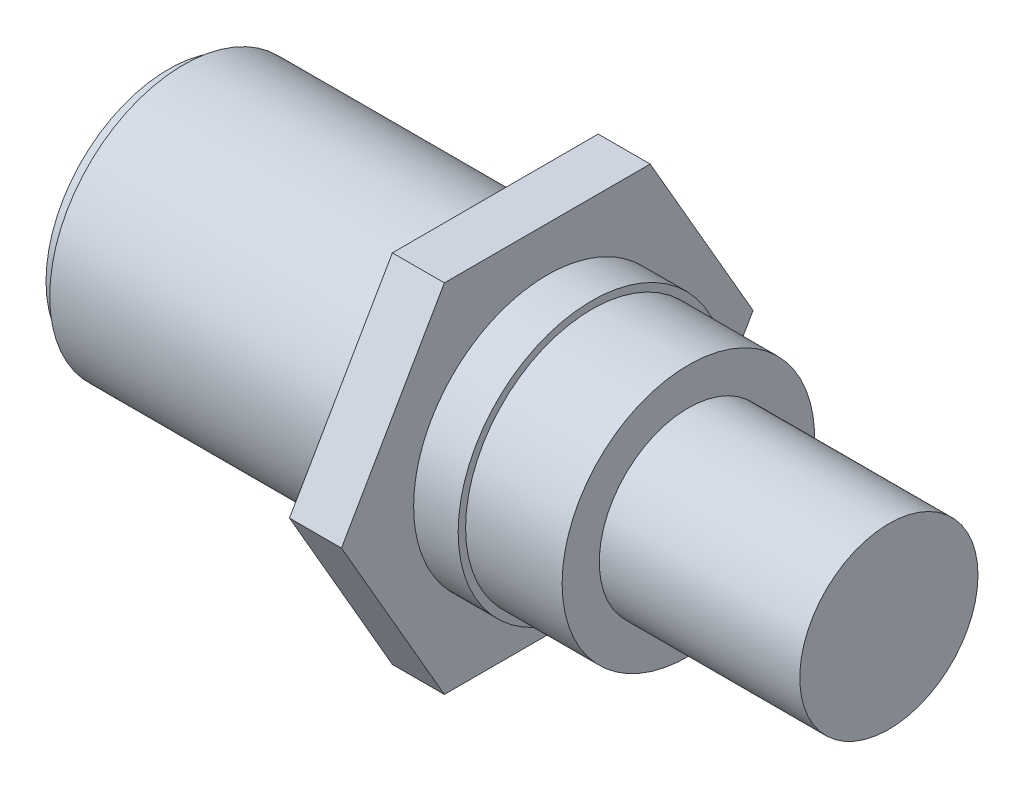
ISO-10303-21;
HEADER;
FILE_DESCRIPTION(('STEP AP214'),'2;1');
FILE_NAME('part.step','',(''),(''),'','','');
FILE_SCHEMA(('AUTOMOTIVE_DESIGN { 1 0 10303 214 1 1 1 1 }'));
ENDSEC;
DATA;
#1=APPLICATION_CONTEXT('core data for automotive mechanical design processes');
#2=APPLICATION_PROTOCOL_DEFINITION('international standard','automotive_design',2000,#1);
#3=PRODUCT_CONTEXT('',#1,'mechanical');
#4=PRODUCT('Part','Part','',(#3));
#5=PRODUCT_RELATED_PRODUCT_CATEGORY('part','',(#4));
#6=PRODUCT_DEFINITION_FORMATION('','',#4);
#7=PRODUCT_DEFINITION_CONTEXT('part definition',#1,'design');
#8=PRODUCT_DEFINITION('design','',#6,#7);
#9=PRODUCT_DEFINITION_SHAPE('','',#8);
#10=(LENGTH_UNIT() NAMED_UNIT(*) SI_UNIT(.MILLI.,.METRE.));
#11=(NAMED_UNIT(*) PLANE_ANGLE_UNIT() SI_UNIT($,.RADIAN.));
#12=(NAMED_UNIT(*) SI_UNIT($,.STERADIAN.) SOLID_ANGLE_UNIT());
#13=UNCERTAINTY_MEASURE_WITH_UNIT(LENGTH_MEASURE(1.E-05),#10,'distance_accuracy_value','');
#14=(GEOMETRIC_REPRESENTATION_CONTEXT(3) GLOBAL_UNCERTAINTY_ASSIGNED_CONTEXT((#13)) GLOBAL_UNIT_ASSIGNED_CONTEXT((#10,
#11,#12)) REPRESENTATION_CONTEXT('',''));
#15=CARTESIAN_POINT('',(0.,0.,0.));
#16=DIRECTION('',(0.,0.,1.));
#17=DIRECTION('',(1.,0.,0.));
#18=AXIS2_PLACEMENT_3D('',#15,#16,#17);
#19=CARTESIAN_POINT('',(24.5,24.,0.));
#20=DIRECTION('',(1.,0.,0.));
#21=DIRECTION('',(0.,0.,-1.));
#22=AXIS2_PLACEMENT_3D('',#19,#20,#21);
#23=PLANE('',#22);
#24=DIRECTION('',(0.,0.866025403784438,0.5));
#25=VECTOR('',#24,1.);
#26=CARTESIAN_POINT('',(24.5,0.,-13.856406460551));
#27=LINE('',#26,#25);
#28=CARTESIAN_POINT('',(24.5,0.,-13.856406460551));
#29=VERTEX_POINT('',#28);
#30=CARTESIAN_POINT('',(24.5,12.,-6.9282032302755));
#31=VERTEX_POINT('',#30);
#32=EDGE_CURVE('E130',#29,#31,#27,.T.);
#33=ORIENTED_EDGE('',*,*,#32,.T.);
#34=DIRECTION('',(0.,0.,1.));
#35=VECTOR('',#34,1.);
#36=CARTESIAN_POINT('',(24.5,12.,-6.9282032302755));
#37=LINE('',#36,#35);
#38=CARTESIAN_POINT('',(24.5,12.,6.92820323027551));
#39=VERTEX_POINT('',#38);
#40=EDGE_CURVE('E111',#31,#39,#37,.T.);
#41=ORIENTED_EDGE('',*,*,#40,.T.);
#42=DIRECTION('',(0.,-0.866025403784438,0.5));
#43=VECTOR('',#42,1.);
#44=CARTESIAN_POINT('',(24.5,12.,6.92820323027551));
#45=LINE('',#44,#43);
#46=CARTESIAN_POINT('',(24.5,0.,13.856406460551));
#47=VERTEX_POINT('',#46);
#48=EDGE_CURVE('E133',#39,#47,#45,.T.);
#49=ORIENTED_EDGE('',*,*,#48,.T.);
#50=DIRECTION('',(0.,-0.866025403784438,-0.5));
#51=VECTOR('',#50,1.);
#52=CARTESIAN_POINT('',(24.5,0.,13.856406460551));
#53=LINE('',#52,#51);
#54=CARTESIAN_POINT('',(24.5,-12.,6.9282032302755));
#55=VERTEX_POINT('',#54);
#56=EDGE_CURVE('E135',#47,#55,#53,.T.);
#57=ORIENTED_EDGE('',*,*,#56,.T.);
#58=DIRECTION('',(0.,0.,-1.));
#59=VECTOR('',#58,1.);
#60=CARTESIAN_POINT('',(24.5,-12.,6.9282032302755));
#61=LINE('',#60,#59);
#62=CARTESIAN_POINT('',(24.5,-12.,-6.92820323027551));
#63=VERTEX_POINT('',#62);
#64=EDGE_CURVE('E64',#55,#63,#61,.T.);
#65=ORIENTED_EDGE('',*,*,#64,.T.);
#66=DIRECTION('',(0.,0.866025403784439,-0.5));
#67=VECTOR('',#66,1.);
#68=CARTESIAN_POINT('',(24.5,-12.,-6.92820323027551));
#69=LINE('',#68,#67);
#70=EDGE_CURVE('E59',#63,#29,#69,.T.);
#71=ORIENTED_EDGE('',*,*,#70,.T.);
#72=EDGE_LOOP('',(#33,#41,#49,#57,#65,#71));
#73=FACE_BOUND('',#72,.T.);
#74=CARTESIAN_POINT('',(24.5,0.,0.));
#75=DIRECTION('',(1.,0.,0.));
#76=DIRECTION('',(0.,0.,-1.));
#77=AXIS2_PLACEMENT_3D('',#74,#75,#76);
#78=CIRCLE('',#77,9.);
#79=CARTESIAN_POINT('',(24.5,0.,-9.));
#80=VERTEX_POINT('',#79);
#81=EDGE_CURVE('E116',#80,#80,#78,.T.);
#82=ORIENTED_EDGE('',*,*,#81,.F.);
#83=EDGE_LOOP('',(#82));
#84=FACE_BOUND('',#83,.T.);
#85=ADVANCED_FACE('F44',(#73,#84),#23,.T.);
#86=CARTESIAN_POINT('',(21.,24.,0.));
#87=DIRECTION('',(1.,0.,0.));
#88=DIRECTION('',(0.,0.,-1.));
#89=AXIS2_PLACEMENT_3D('',#86,#87,#88);
#90=PLANE('',#89);
#91=DIRECTION('',(0.,0.866025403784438,0.5));
#92=VECTOR('',#91,1.);
#93=CARTESIAN_POINT('',(21.,0.,-13.856406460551));
#94=LINE('',#93,#92);
#95=CARTESIAN_POINT('',(21.,0.,-13.856406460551));
#96=VERTEX_POINT('',#95);
#97=CARTESIAN_POINT('',(21.,12.,-6.9282032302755));
#98=VERTEX_POINT('',#97);
#99=EDGE_CURVE('E102',#96,#98,#94,.T.);
#100=ORIENTED_EDGE('',*,*,#99,.F.);
#101=DIRECTION('',(0.,0.866025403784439,-0.5));
#102=VECTOR('',#101,1.);
#103=CARTESIAN_POINT('',(21.,-12.,-6.92820323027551));
#104=LINE('',#103,#102);
#105=CARTESIAN_POINT('',(21.,-12.,-6.92820323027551));
#106=VERTEX_POINT('',#105);
#107=EDGE_CURVE('E128',#106,#96,#104,.T.);
#108=ORIENTED_EDGE('',*,*,#107,.F.);
#109=DIRECTION('',(0.,0.,-1.));
#110=VECTOR('',#109,1.);
#111=CARTESIAN_POINT('',(21.,-12.,6.9282032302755));
#112=LINE('',#111,#110);
#113=CARTESIAN_POINT('',(21.,-12.,6.9282032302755));
#114=VERTEX_POINT('',#113);
#115=EDGE_CURVE('E126',#114,#106,#112,.T.);
#116=ORIENTED_EDGE('',*,*,#115,.F.);
#117=DIRECTION('',(0.,-0.866025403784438,-0.5));
#118=VECTOR('',#117,1.);
#119=CARTESIAN_POINT('',(21.,0.,13.856406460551));
#120=LINE('',#119,#118);
#121=CARTESIAN_POINT('',(21.,0.,13.856406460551));
#122=VERTEX_POINT('',#121);
#123=EDGE_CURVE('E124',#122,#114,#120,.T.);
#124=ORIENTED_EDGE('',*,*,#123,.F.);
#125=DIRECTION('',(0.,-0.866025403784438,0.5));
#126=VECTOR('',#125,1.);
#127=CARTESIAN_POINT('',(21.,12.,6.92820323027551));
#128=LINE('',#127,#126);
#129=CARTESIAN_POINT('',(21.,12.,6.92820323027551));
#130=VERTEX_POINT('',#129);
#131=EDGE_CURVE('E104',#130,#122,#128,.T.);
#132=ORIENTED_EDGE('',*,*,#131,.F.);
#133=DIRECTION('',(0.,0.,1.));
#134=VECTOR('',#133,1.);
#135=CARTESIAN_POINT('',(21.,12.,-6.9282032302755));
#136=LINE('',#135,#134);
#137=EDGE_CURVE('E97',#98,#130,#136,.T.);
#138=ORIENTED_EDGE('',*,*,#137,.F.);
#139=EDGE_LOOP('',(#100,#108,#116,#124,#132,#138));
#140=FACE_BOUND('',#139,.T.);
#141=CARTESIAN_POINT('',(21.,0.,0.));
#142=DIRECTION('',(1.,0.,0.));
#143=DIRECTION('',(0.,0.,-1.));
#144=AXIS2_PLACEMENT_3D('',#141,#142,#143);
#145=CIRCLE('',#144,9.);
#146=CARTESIAN_POINT('',(21.,0.,-9.));
#147=VERTEX_POINT('',#146);
#148=EDGE_CURVE('E119',#147,#147,#145,.T.);
#149=ORIENTED_EDGE('',*,*,#148,.T.);
#150=EDGE_LOOP('',(#149));
#151=FACE_BOUND('',#150,.T.);
#152=ADVANCED_FACE('F98',(#140,#151),#90,.F.);
#153=CARTESIAN_POINT('',(24.5,0.,-13.856406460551));
#154=DIRECTION('',(0.,-0.5,0.866025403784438));
#155=DIRECTION('',(0.,-0.866025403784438,-0.5));
#156=AXIS2_PLACEMENT_3D('',#153,#154,#155);
#157=PLANE('',#156);
#158=ORIENTED_EDGE('',*,*,#99,.T.);
#159=DIRECTION('',(-1.,0.,0.));
#160=VECTOR('',#159,1.);
#161=CARTESIAN_POINT('',(24.5,12.,-6.9282032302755));
#162=LINE('',#161,#160);
#163=EDGE_CURVE('E12',#31,#98,#162,.T.);
#164=ORIENTED_EDGE('',*,*,#163,.F.);
#165=ORIENTED_EDGE('',*,*,#32,.F.);
#166=DIRECTION('',(-1.,0.,0.));
#167=VECTOR('',#166,1.);
#168=CARTESIAN_POINT('',(24.5,0.,-13.856406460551));
#169=LINE('',#168,#167);
#170=EDGE_CURVE('E115',#29,#96,#169,.T.);
#171=ORIENTED_EDGE('',*,*,#170,.T.);
#172=EDGE_LOOP('',(#158,#164,#165,#171));
#173=FACE_BOUND('',#172,.T.);
#174=ADVANCED_FACE('F46',(#173),#157,.F.);
#175=CARTESIAN_POINT('',(24.5,12.,-6.9282032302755));
#176=DIRECTION('',(0.,-1.,0.));
#177=DIRECTION('',(0.,0.,-1.));
#178=AXIS2_PLACEMENT_3D('',#175,#176,#177);
#179=PLANE('',#178);
#180=ORIENTED_EDGE('',*,*,#137,.T.);
#181=DIRECTION('',(-1.,0.,0.));
#182=VECTOR('',#181,1.);
#183=CARTESIAN_POINT('',(24.5,12.,6.92820323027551));
#184=LINE('',#183,#182);
#185=EDGE_CURVE('E52',#39,#130,#184,.T.);
#186=ORIENTED_EDGE('',*,*,#185,.F.);
#187=ORIENTED_EDGE('',*,*,#40,.F.);
#188=ORIENTED_EDGE('',*,*,#163,.T.);
#189=EDGE_LOOP('',(#180,#186,#187,#188));
#190=FACE_BOUND('',#189,.T.);
#191=ADVANCED_FACE('F110',(#190),#179,.F.);
#192=CARTESIAN_POINT('',(24.5,12.,6.92820323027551));
#193=DIRECTION('',(0.,-0.5,-0.866025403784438));
#194=DIRECTION('',(0.,0.866025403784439,-0.5));
#195=AXIS2_PLACEMENT_3D('',#192,#193,#194);
#196=PLANE('',#195);
#197=ORIENTED_EDGE('',*,*,#131,.T.);
#198=DIRECTION('',(-1.,0.,0.));
#199=VECTOR('',#198,1.);
#200=CARTESIAN_POINT('',(24.5,0.,13.856406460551));
#201=LINE('',#200,#199);
#202=EDGE_CURVE('E146',#47,#122,#201,.T.);
#203=ORIENTED_EDGE('',*,*,#202,.F.);
#204=ORIENTED_EDGE('',*,*,#48,.F.);
#205=ORIENTED_EDGE('',*,*,#185,.T.);
#206=EDGE_LOOP('',(#197,#203,#204,#205));
#207=FACE_BOUND('',#206,.T.);
#208=ADVANCED_FACE('F150',(#207),#196,.F.);
#209=CARTESIAN_POINT('',(24.5,0.,13.856406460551));
#210=DIRECTION('',(0.,0.5,-0.866025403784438));
#211=DIRECTION('',(0.,0.866025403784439,0.5));
#212=AXIS2_PLACEMENT_3D('',#209,#210,#211);
#213=PLANE('',#212);
#214=ORIENTED_EDGE('',*,*,#123,.T.);
#215=DIRECTION('',(-1.,0.,0.));
#216=VECTOR('',#215,1.);
#217=CARTESIAN_POINT('',(24.5,-12.,6.9282032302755));
#218=LINE('',#217,#216);
#219=EDGE_CURVE('E143',#55,#114,#218,.T.);
#220=ORIENTED_EDGE('',*,*,#219,.F.);
#221=ORIENTED_EDGE('',*,*,#56,.F.);
#222=ORIENTED_EDGE('',*,*,#202,.T.);
#223=EDGE_LOOP('',(#214,#220,#221,#222));
#224=FACE_BOUND('',#223,.T.);
#225=ADVANCED_FACE('F156',(#224),#213,.F.);
#226=CARTESIAN_POINT('',(24.5,-12.,6.9282032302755));
#227=DIRECTION('',(0.,1.,0.));
#228=DIRECTION('',(0.,0.,1.));
#229=AXIS2_PLACEMENT_3D('',#226,#227,#228);
#230=PLANE('',#229);
#231=ORIENTED_EDGE('',*,*,#115,.T.);
#232=DIRECTION('',(-1.,0.,0.));
#233=VECTOR('',#232,1.);
#234=CARTESIAN_POINT('',(24.5,-12.,-6.92820323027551));
#235=LINE('',#234,#233);
#236=EDGE_CURVE('E140',#63,#106,#235,.T.);
#237=ORIENTED_EDGE('',*,*,#236,.F.);
#238=ORIENTED_EDGE('',*,*,#64,.F.);
#239=ORIENTED_EDGE('',*,*,#219,.T.);
#240=EDGE_LOOP('',(#231,#237,#238,#239));
#241=FACE_BOUND('',#240,.T.);
#242=ADVANCED_FACE('F159',(#241),#230,.F.);
#243=CARTESIAN_POINT('',(24.5,-12.,-6.92820323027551));
#244=DIRECTION('',(0.,0.5,0.866025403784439));
#245=DIRECTION('',(0.,-0.866025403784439,0.5));
#246=AXIS2_PLACEMENT_3D('',#243,#244,#245);
#247=PLANE('',#246);
#248=ORIENTED_EDGE('',*,*,#107,.T.);
#249=ORIENTED_EDGE('',*,*,#170,.F.);
#250=ORIENTED_EDGE('',*,*,#70,.F.);
#251=ORIENTED_EDGE('',*,*,#236,.T.);
#252=EDGE_LOOP('',(#248,#249,#250,#251));
#253=FACE_BOUND('',#252,.T.);
#254=ADVANCED_FACE('F161',(#253),#247,.F.);
#255=CARTESIAN_POINT('',(24.5,0.,0.));
#256=DIRECTION('',(-1.,0.,0.));
#257=DIRECTION('',(0.,0.,1.));
#258=AXIS2_PLACEMENT_3D('',#255,#256,#257);
#259=CYLINDRICAL_SURFACE('',#258,9.);
#260=ORIENTED_EDGE('',*,*,#81,.T.);
#261=EDGE_LOOP('',(#260));
#262=FACE_BOUND('',#261,.T.);
#263=ORIENTED_EDGE('',*,*,#148,.F.);
#264=EDGE_LOOP('',(#263));
#265=FACE_BOUND('',#264,.T.);
#266=ADVANCED_FACE('F163',(#262,#265),#259,.F.);
#267=CLOSED_SHELL('',(#85,#152,#174,#191,#208,#225,#242,#254,#266));
#268=MANIFOLD_SOLID_BREP('B2',#267);
#269=CARTESIAN_POINT('',(34.,0.,0.));
#270=DIRECTION('',(1.,0.,0.));
#271=DIRECTION('',(0.,0.,-1.));
#272=AXIS2_PLACEMENT_3D('',#269,#270,#271);
#273=PLANE('',#272);
#274=CARTESIAN_POINT('',(34.,0.,0.));
#275=DIRECTION('',(1.,0.,0.));
#276=DIRECTION('',(0.,0.,-1.));
#277=AXIS2_PLACEMENT_3D('',#274,#275,#276);
#278=CIRCLE('',#277,8.5);
#279=CARTESIAN_POINT('',(34.,0.,8.5));
#280=VERTEX_POINT('',#279);
#281=EDGE_CURVE('E263',#280,#280,#278,.T.);
#282=ORIENTED_EDGE('',*,*,#281,.T.);
#283=EDGE_LOOP('',(#282));
#284=FACE_BOUND('',#283,.T.);
#285=CARTESIAN_POINT('',(34.,0.,0.));
#286=DIRECTION('',(1.,0.,0.));
#287=DIRECTION('',(0.,0.,-1.));
#288=AXIS2_PLACEMENT_3D('',#285,#286,#287);
#289=CIRCLE('',#288,6.);
#290=CARTESIAN_POINT('',(34.,0.,-6.));
#291=VERTEX_POINT('',#290);
#292=EDGE_CURVE('E269',#291,#291,#289,.T.);
#293=ORIENTED_EDGE('',*,*,#292,.F.);
#294=EDGE_LOOP('',(#293));
#295=FACE_BOUND('',#294,.T.);
#296=ADVANCED_FACE('F240',(#284,#295),#273,.T.);
#297=CARTESIAN_POINT('',(27.5,0.,0.));
#298=DIRECTION('',(-1.,0.,0.));
#299=DIRECTION('',(0.,0.,1.));
#300=AXIS2_PLACEMENT_3D('',#297,#298,#299);
#301=PLANE('',#300);
#302=CARTESIAN_POINT('',(27.5,0.,0.));
#303=DIRECTION('',(-1.,0.,0.));
#304=DIRECTION('',(0.,0.,1.));
#305=AXIS2_PLACEMENT_3D('',#302,#303,#304);
#306=CIRCLE('',#305,9.);
#307=CARTESIAN_POINT('',(27.5,0.,9.));
#308=VERTEX_POINT('',#307);
#309=EDGE_CURVE('E255',#308,#308,#306,.T.);
#310=ORIENTED_EDGE('',*,*,#309,.F.);
#311=EDGE_LOOP('',(#310));
#312=FACE_BOUND('',#311,.T.);
#313=CARTESIAN_POINT('',(27.5,0.,0.));
#314=DIRECTION('',(-1.,0.,0.));
#315=DIRECTION('',(0.,0.,1.));
#316=AXIS2_PLACEMENT_3D('',#313,#314,#315);
#317=CIRCLE('',#316,8.5);
#318=CARTESIAN_POINT('',(27.5,0.,8.5));
#319=VERTEX_POINT('',#318);
#320=EDGE_CURVE('E43',#319,#319,#317,.F.);
#321=ORIENTED_EDGE('',*,*,#320,.F.);
#322=EDGE_LOOP('',(#321));
#323=FACE_BOUND('',#322,.T.);
#324=ADVANCED_FACE('F276',(#312,#323),#301,.F.);
#325=CARTESIAN_POINT('',(0.,0.,0.));
#326=DIRECTION('',(1.,0.,0.));
#327=DIRECTION('',(0.,0.,-1.));
#328=AXIS2_PLACEMENT_3D('',#325,#326,#327);
#329=PLANE('',#328);
#330=CARTESIAN_POINT('',(0.,0.,0.));
#331=DIRECTION('',(-1.,0.,0.));
#332=DIRECTION('',(0.,0.,1.));
#333=AXIS2_PLACEMENT_3D('',#330,#331,#332);
#334=CIRCLE('',#333,9.);
#335=CARTESIAN_POINT('',(0.,0.,9.));
#336=VERTEX_POINT('',#335);
#337=EDGE_CURVE('E251',#336,#336,#334,.T.);
#338=ORIENTED_EDGE('',*,*,#337,.T.);
#339=EDGE_LOOP('',(#338));
#340=FACE_BOUND('',#339,.T.);
#341=CARTESIAN_POINT('',(0.,0.,0.));
#342=DIRECTION('',(1.,0.,0.));
#343=DIRECTION('',(0.,0.,-1.));
#344=AXIS2_PLACEMENT_3D('',#341,#342,#343);
#345=CIRCLE('',#344,8.25);
#346=CARTESIAN_POINT('',(0.,0.,-8.25));
#347=VERTEX_POINT('',#346);
#348=EDGE_CURVE('E247',#347,#347,#345,.F.);
#349=ORIENTED_EDGE('',*,*,#348,.F.);
#350=EDGE_LOOP('',(#349));
#351=FACE_BOUND('',#350,.T.);
#352=ADVANCED_FACE('F242',(#340,#351),#329,.F.);
#353=CARTESIAN_POINT('',(0.,0.,0.));
#354=DIRECTION('',(-1.,0.,0.));
#355=DIRECTION('',(0.,0.,1.));
#356=AXIS2_PLACEMENT_3D('',#353,#354,#355);
#357=CYLINDRICAL_SURFACE('',#356,9.);
#358=ORIENTED_EDGE('',*,*,#337,.F.);
#359=EDGE_LOOP('',(#358));
#360=FACE_BOUND('',#359,.T.);
#361=ORIENTED_EDGE('',*,*,#309,.T.);
#362=EDGE_LOOP('',(#361));
#363=FACE_BOUND('',#362,.T.);
#364=ADVANCED_FACE('F297',(#360,#363),#357,.T.);
#365=CARTESIAN_POINT('',(-1.,0.,0.));
#366=DIRECTION('',(1.,0.,0.));
#367=DIRECTION('',(0.,0.,-1.));
#368=AXIS2_PLACEMENT_3D('',#365,#366,#367);
#369=CYLINDRICAL_SURFACE('',#368,8.25);
#370=CARTESIAN_POINT('',(-1.,0.,0.));
#371=DIRECTION('',(-1.,0.,0.));
#372=DIRECTION('',(0.,0.,1.));
#373=AXIS2_PLACEMENT_3D('',#370,#371,#372);
#374=CIRCLE('',#373,8.25);
#375=CARTESIAN_POINT('',(-1.,0.,8.25));
#376=VERTEX_POINT('',#375);
#377=EDGE_CURVE('E260',#376,#376,#374,.T.);
#378=ORIENTED_EDGE('',*,*,#377,.F.);
#379=EDGE_LOOP('',(#378));
#380=FACE_BOUND('',#379,.T.);
#381=ORIENTED_EDGE('',*,*,#348,.T.);
#382=EDGE_LOOP('',(#381));
#383=FACE_BOUND('',#382,.T.);
#384=ADVANCED_FACE('F294',(#380,#383),#369,.T.);
#385=CARTESIAN_POINT('',(-1.,0.,0.));
#386=DIRECTION('',(-1.,0.,0.));
#387=DIRECTION('',(0.,0.,1.));
#388=AXIS2_PLACEMENT_3D('',#385,#386,#387);
#389=PLANE('',#388);
#390=ORIENTED_EDGE('',*,*,#377,.T.);
#391=EDGE_LOOP('',(#390));
#392=FACE_BOUND('',#391,.T.);
#393=ADVANCED_FACE('F290',(#392),#389,.T.);
#394=CARTESIAN_POINT('',(34.,0.,0.));
#395=DIRECTION('',(-1.,0.,0.));
#396=DIRECTION('',(0.,0.,1.));
#397=AXIS2_PLACEMENT_3D('',#394,#395,#396);
#398=CYLINDRICAL_SURFACE('',#397,8.5);
#399=CARTESIAN_POINT('',(34.,0.,8.5));
#400=CARTESIAN_POINT('',(33.9322916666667,0.,8.5));
#401=CARTESIAN_POINT('',(33.8645833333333,0.,8.5));
#402=CARTESIAN_POINT('',(33.7291666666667,0.,8.5));
#403=CARTESIAN_POINT('',(33.6614583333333,0.,8.5));
#404=CARTESIAN_POINT('',(33.5260416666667,0.,8.5));
#405=CARTESIAN_POINT('',(33.4583333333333,0.,8.5));
#406=CARTESIAN_POINT('',(33.3229166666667,0.,8.5));
#407=CARTESIAN_POINT('',(33.2552083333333,0.,8.5));
#408=CARTESIAN_POINT('',(33.1197916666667,0.,8.5));
#409=CARTESIAN_POINT('',(33.0520833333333,0.,8.5));
#410=CARTESIAN_POINT('',(32.9166666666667,0.,8.5));
#411=CARTESIAN_POINT('',(32.8489583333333,0.,8.5));
#412=CARTESIAN_POINT('',(32.7135416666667,0.,8.5));
#413=CARTESIAN_POINT('',(32.6458333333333,0.,8.5));
#414=CARTESIAN_POINT('',(32.5104166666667,0.,8.5));
#415=CARTESIAN_POINT('',(32.4427083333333,0.,8.5));
#416=CARTESIAN_POINT('',(32.3072916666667,0.,8.5));
#417=CARTESIAN_POINT('',(32.2395833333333,0.,8.5));
#418=CARTESIAN_POINT('',(32.1041666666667,0.,8.5));
#419=CARTESIAN_POINT('',(32.0364583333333,0.,8.5));
#420=CARTESIAN_POINT('',(31.9010416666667,0.,8.5));
#421=CARTESIAN_POINT('',(31.8333333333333,0.,8.5));
#422=CARTESIAN_POINT('',(31.6979166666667,0.,8.5));
#423=CARTESIAN_POINT('',(31.6302083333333,0.,8.5));
#424=CARTESIAN_POINT('',(31.4947916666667,0.,8.5));
#425=CARTESIAN_POINT('',(31.4270833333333,0.,8.5));
#426=CARTESIAN_POINT('',(31.2916666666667,0.,8.5));
#427=CARTESIAN_POINT('',(31.2239583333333,0.,8.5));
#428=CARTESIAN_POINT('',(31.0885416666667,0.,8.5));
#429=CARTESIAN_POINT('',(31.0208333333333,0.,8.5));
#430=CARTESIAN_POINT('',(30.8854166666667,0.,8.5));
#431=CARTESIAN_POINT('',(30.8177083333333,0.,8.5));
#432=CARTESIAN_POINT('',(30.6822916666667,0.,8.5));
#433=CARTESIAN_POINT('',(30.6145833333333,0.,8.5));
#434=CARTESIAN_POINT('',(30.4791666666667,0.,8.5));
#435=CARTESIAN_POINT('',(30.4114583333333,0.,8.5));
#436=CARTESIAN_POINT('',(30.2760416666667,0.,8.5));
#437=CARTESIAN_POINT('',(30.2083333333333,0.,8.5));
#438=CARTESIAN_POINT('',(30.0729166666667,0.,8.5));
#439=CARTESIAN_POINT('',(30.0052083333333,0.,8.5));
#440=CARTESIAN_POINT('',(29.8697916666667,0.,8.5));
#441=CARTESIAN_POINT('',(29.8020833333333,0.,8.5));
#442=CARTESIAN_POINT('',(29.6666666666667,0.,8.5));
#443=CARTESIAN_POINT('',(29.5989583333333,0.,8.5));
#444=CARTESIAN_POINT('',(29.4635416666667,0.,8.5));
#445=CARTESIAN_POINT('',(29.3958333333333,0.,8.5));
#446=CARTESIAN_POINT('',(29.2604166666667,0.,8.5));
#447=CARTESIAN_POINT('',(29.1927083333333,0.,8.5));
#448=CARTESIAN_POINT('',(29.0572916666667,0.,8.5));
#449=CARTESIAN_POINT('',(28.9895833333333,0.,8.5));
#450=CARTESIAN_POINT('',(28.8541666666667,0.,8.5));
#451=CARTESIAN_POINT('',(28.7864583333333,0.,8.5));
#452=CARTESIAN_POINT('',(28.6510416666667,0.,8.5));
#453=CARTESIAN_POINT('',(28.5833333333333,0.,8.5));
#454=CARTESIAN_POINT('',(28.4479166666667,0.,8.5));
#455=CARTESIAN_POINT('',(28.3802083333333,0.,8.5));
#456=CARTESIAN_POINT('',(28.2447916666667,0.,8.5));
#457=CARTESIAN_POINT('',(28.1770833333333,0.,8.5));
#458=CARTESIAN_POINT('',(28.0416666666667,0.,8.5));
#459=CARTESIAN_POINT('',(27.9739583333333,0.,8.5));
#460=CARTESIAN_POINT('',(27.8385416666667,0.,8.5));
#461=CARTESIAN_POINT('',(27.7708333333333,0.,8.5));
#462=CARTESIAN_POINT('',(27.6354166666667,0.,8.5));
#463=CARTESIAN_POINT('',(27.5677083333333,0.,8.5));
#464=CARTESIAN_POINT('',(27.5,0.,8.5));
#465=B_SPLINE_CURVE_WITH_KNOTS('',3,(#399,#400,#401,#402,#403,#404,#405,#406,#407,#408,#409,
#410,#411,#412,#413,#414,#415,#416,#417,#418,#419,#420,#421,#422,#423,#424,#425,#426,#427,#428,
#429,#430,#431,#432,#433,#434,#435,#436,#437,#438,#439,#440,#441,#442,#443,#444,#445,#446,#447,
#448,#449,#450,#451,#452,#453,#454,#455,#456,#457,#458,#459,#460,#461,#462,#463,#464),
.UNSPECIFIED.,.F.,.F.,(4,2,2,2,2,2,2,2,2,2,2,2,2,2,2,2,2,2,2,2,2,2,2,2,2,2,2,2,2,2,2,2,4),(0.,
0.203125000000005,0.406250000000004,0.609375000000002,0.812500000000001,1.015625,1.21875,
1.421875,1.625,1.828125,2.03125,2.234375,2.4375,2.640625,2.84375,3.046875,3.25,3.453125,3.65625,
3.859375,4.0625,4.265625,4.46875,4.671875,4.875,5.078125,5.28125,5.484375,5.6875,5.890625,
6.09374999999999,6.296875,6.5),.UNSPECIFIED.);
#466=EDGE_CURVE('BSEAM287',#280,#319,#465,.T.);
#467=ORIENTED_EDGE('',*,*,#281,.F.);
#468=ORIENTED_EDGE('',*,*,#320,.T.);
#469=ORIENTED_EDGE('',*,*,#466,.T.);
#470=ORIENTED_EDGE('',*,*,#466,.F.);
#471=EDGE_LOOP('',(#467,#469,#468,#470));
#472=FACE_BOUND('',#471,.T.);
#473=ADVANCED_FACE('F287',(#472),#398,.T.);
#474=CARTESIAN_POINT('',(47.5,0.,0.));
#475=DIRECTION('',(-1.,0.,0.));
#476=DIRECTION('',(0.,0.,1.));
#477=AXIS2_PLACEMENT_3D('',#474,#475,#476);
#478=CYLINDRICAL_SURFACE('',#477,6.);
#479=CARTESIAN_POINT('',(47.5,0.,0.));
#480=DIRECTION('',(1.,0.,0.));
#481=DIRECTION('',(0.,0.,-1.));
#482=AXIS2_PLACEMENT_3D('',#479,#480,#481);
#483=CIRCLE('',#482,6.);
#484=CARTESIAN_POINT('',(47.5,0.,-6.));
#485=VERTEX_POINT('',#484);
#486=EDGE_CURVE('E266',#485,#485,#483,.T.);
#487=ORIENTED_EDGE('',*,*,#486,.F.);
#488=EDGE_LOOP('',(#487));
#489=FACE_BOUND('',#488,.T.);
#490=ORIENTED_EDGE('',*,*,#292,.T.);
#491=EDGE_LOOP('',(#490));
#492=FACE_BOUND('',#491,.T.);
#493=ADVANCED_FACE('F273',(#489,#492),#478,.T.);
#494=CARTESIAN_POINT('',(47.5,0.,0.));
#495=DIRECTION('',(1.,0.,0.));
#496=DIRECTION('',(0.,0.,-1.));
#497=AXIS2_PLACEMENT_3D('',#494,#495,#496);
#498=PLANE('',#497);
#499=ORIENTED_EDGE('',*,*,#486,.T.);
#500=EDGE_LOOP('',(#499));
#501=FACE_BOUND('',#500,.T.);
#502=ADVANCED_FACE('F339',(#501),#498,.T.);
#503=CLOSED_SHELL('',(#296,#324,#352,#364,#384,#393,#473,#493,#502));
#504=MANIFOLD_SOLID_BREP('B6',#503);
#505=ADVANCED_BREP_SHAPE_REPRESENTATION('',(#18,#268,#504),#14);
#506=SHAPE_DEFINITION_REPRESENTATION(#9,#505);
ENDSEC;
END-ISO-10303-21;
